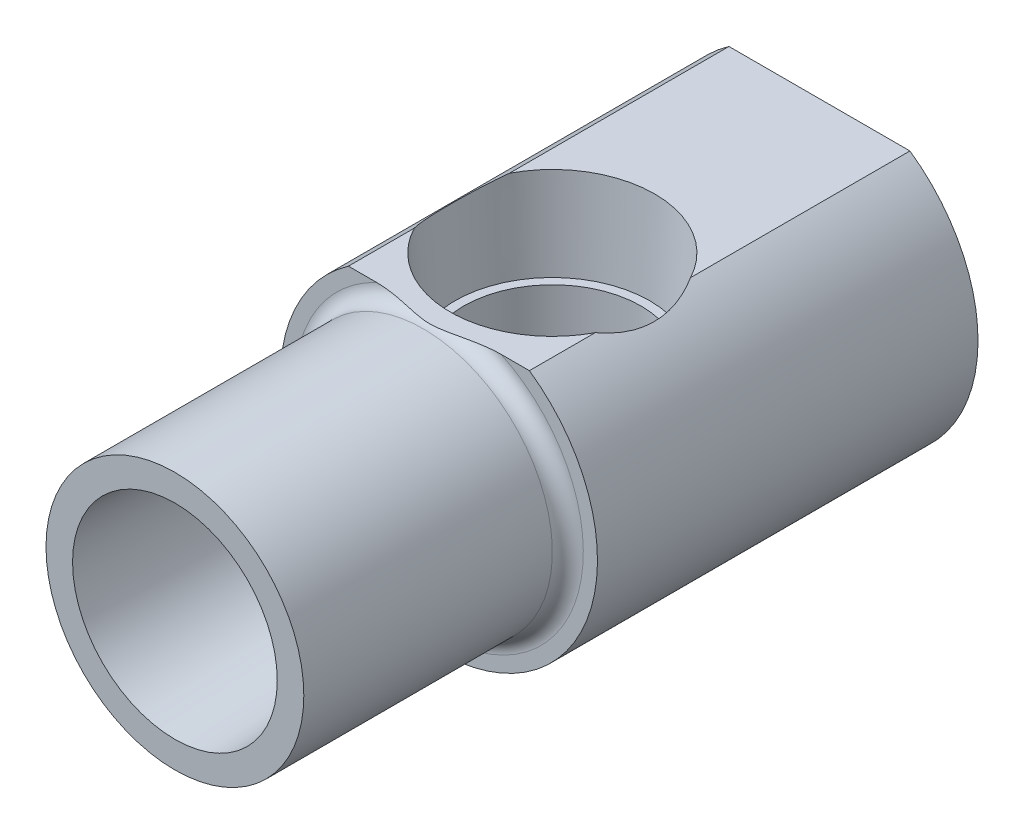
ISO-10303-21;
HEADER;
FILE_DESCRIPTION(('STEP AP214'),'2;1');
FILE_NAME('part.step','',(''),(''),'','','');
FILE_SCHEMA(('AUTOMOTIVE_DESIGN { 1 0 10303 214 1 1 1 1 }'));
ENDSEC;
DATA;
#1=APPLICATION_CONTEXT('core data for automotive mechanical design processes');
#2=APPLICATION_PROTOCOL_DEFINITION('international standard','automotive_design',2000,#1);
#3=PRODUCT_CONTEXT('',#1,'mechanical');
#4=PRODUCT('Part','Part','',(#3));
#5=PRODUCT_RELATED_PRODUCT_CATEGORY('part','',(#4));
#6=PRODUCT_DEFINITION_FORMATION('','',#4);
#7=PRODUCT_DEFINITION_CONTEXT('part definition',#1,'design');
#8=PRODUCT_DEFINITION('design','',#6,#7);
#9=PRODUCT_DEFINITION_SHAPE('','',#8);
#10=(LENGTH_UNIT() NAMED_UNIT(*) SI_UNIT(.MILLI.,.METRE.));
#11=(NAMED_UNIT(*) PLANE_ANGLE_UNIT() SI_UNIT($,.RADIAN.));
#12=(NAMED_UNIT(*) SI_UNIT($,.STERADIAN.) SOLID_ANGLE_UNIT());
#13=UNCERTAINTY_MEASURE_WITH_UNIT(LENGTH_MEASURE(1.E-05),#10,'distance_accuracy_value','');
#14=(GEOMETRIC_REPRESENTATION_CONTEXT(3) GLOBAL_UNCERTAINTY_ASSIGNED_CONTEXT((#13)) GLOBAL_UNIT_ASSIGNED_CONTEXT((#10,
#11,#12)) REPRESENTATION_CONTEXT('',''));
#15=CARTESIAN_POINT('',(0.,0.,0.));
#16=DIRECTION('',(0.,0.,1.));
#17=DIRECTION('',(1.,0.,0.));
#18=AXIS2_PLACEMENT_3D('',#15,#16,#17);
#19=CARTESIAN_POINT('',(0.,-0.0611909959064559,-6.26122966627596));
#20=DIRECTION('',(0.,0.221617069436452,0.975133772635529));
#21=DIRECTION('',(0.,-0.975133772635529,0.221617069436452));
#22=AXIS2_PLACEMENT_3D('',#19,#20,#21);
#23=CONICAL_SURFACE('',#22,4.23998477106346,0.0839179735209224);
#24=CARTESIAN_POINT('',(0.,1.96844905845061,12.3651454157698));
#25=DIRECTION('',(0.,-1.,0.));
#26=DIRECTION('',(0.,0.,1.));
#27=AXIS2_PLACEMENT_3D('',#24,#25,#26);
#28=ELLIPSE('',#27,26.1966635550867,5.39334577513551);
#29=CARTESIAN_POINT('',(-0.278305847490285,1.9684490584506,-13.7966174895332));
#30=VERTEX_POINT('',#29);
#31=CARTESIAN_POINT('',(0.278305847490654,1.9684490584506,-13.7966174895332));
#32=VERTEX_POINT('',#31);
#33=EDGE_CURVE('E240',#30,#32,#28,.T.);
#34=ORIENTED_EDGE('',*,*,#33,.F.);
#35=CARTESIAN_POINT('',(1.04745058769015,1.78154510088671,-13.9141804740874));
#36=CARTESIAN_POINT('',(0.984457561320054,1.80628316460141,-13.8987397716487));
#37=CARTESIAN_POINT('',(0.920346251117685,1.8289900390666,-13.884519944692));
#38=CARTESIAN_POINT('',(0.790174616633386,1.87004304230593,-13.85875113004));
#39=CARTESIAN_POINT('',(0.724113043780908,1.88838630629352,-13.8472038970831));
#40=CARTESIAN_POINT('',(0.590512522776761,1.92035640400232,-13.827045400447));
#41=CARTESIAN_POINT('',(0.522975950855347,1.93399030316,-13.8184297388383));
#42=CARTESIAN_POINT('',(0.386807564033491,1.95633483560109,-13.8042943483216));
#43=CARTESIAN_POINT('',(0.318176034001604,1.96504672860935,-13.7987738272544));
#44=CARTESIAN_POINT('',(0.110722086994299,1.98356031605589,-13.7870398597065));
#45=CARTESIAN_POINT('',(-0.0291890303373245,1.98562568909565,-13.7857263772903));
#46=CARTESIAN_POINT('',(-0.307098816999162,1.96889898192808,-13.7963337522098));
#47=CARTESIAN_POINT('',(-0.445098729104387,1.95012116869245,-13.808245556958));
#48=CARTESIAN_POINT('',(-0.660528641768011,1.90481500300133,-13.8368517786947));
#49=CARTESIAN_POINT('',(-0.739872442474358,1.88449738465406,-13.8496605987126));
#50=CARTESIAN_POINT('',(-0.895813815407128,1.83759126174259,-13.8791312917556));
#51=CARTESIAN_POINT('',(-0.972415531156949,1.8110127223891,-13.8957870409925));
#52=CARTESIAN_POINT('',(-1.04745058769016,1.78154510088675,-13.9141804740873));
#53=B_SPLINE_CURVE_WITH_KNOTS('',3,(#35,#36,#37,#38,#39,#40,#41,#42,#43,#44,#45,#46,#47,#48,#49,
#50,#51,#52),.UNSPECIFIED.,.F.,.F.,(4,2,2,2,2,2,2,2,4),(0.,0.208225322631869,0.41658697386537,
0.624634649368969,0.832629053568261,1.2500670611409,1.66721951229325,1.91557542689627,
2.16353868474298),.UNSPECIFIED.);
#54=EDGE_CURVE('E110',#32,#30,#53,.T.);
#55=ORIENTED_EDGE('',*,*,#54,.F.);
#56=EDGE_LOOP('',(#34,#55));
#57=FACE_BOUND('',#56,.T.);
#58=CARTESIAN_POINT('',(-1.70352259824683,-5.04464323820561,-14.5715056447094));
#59=CARTESIAN_POINT('',(-1.65770976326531,-5.07554222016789,-14.6102429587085));
#60=CARTESIAN_POINT('',(-1.61026644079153,-5.10591733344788,-14.6475351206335));
#61=CARTESIAN_POINT('',(-1.51197859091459,-5.16519074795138,-14.7188224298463));
#62=CARTESIAN_POINT('',(-1.46112947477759,-5.19408696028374,-14.752812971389));
#63=CARTESIAN_POINT('',(-1.35599869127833,-5.24989479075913,-14.8169914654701));
#64=CARTESIAN_POINT('',(-1.30171593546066,-5.27680577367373,-14.8471782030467));
#65=CARTESIAN_POINT('',(-1.18991605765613,-5.32806218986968,-14.9033418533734));
#66=CARTESIAN_POINT('',(-1.13240054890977,-5.35240888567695,-14.9293208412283));
#67=CARTESIAN_POINT('',(-0.954397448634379,-5.42111526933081,-15.0009039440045));
#68=CARTESIAN_POINT('',(-0.829179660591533,-5.46074246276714,-15.0397048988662));
#69=CARTESIAN_POINT('',(-0.57076009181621,-5.5233743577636,-15.0990149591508));
#70=CARTESIAN_POINT('',(-0.437566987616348,-5.54639678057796,-15.1195435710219));
#71=CARTESIAN_POINT('',(-0.180997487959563,-5.57267290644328,-15.1427769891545));
#72=CARTESIAN_POINT('',(-0.0579266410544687,-5.57763189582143,-15.14702147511));
#73=CARTESIAN_POINT('',(0.187614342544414,-5.57227066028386,-15.1423559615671));
#74=CARTESIAN_POINT('',(0.310084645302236,-5.56195492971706,-15.1334498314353));
#75=CARTESIAN_POINT('',(0.553761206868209,-5.52627202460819,-15.1013561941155));
#76=CARTESIAN_POINT('',(0.674878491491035,-5.50057458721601,-15.0778548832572));
#77=CARTESIAN_POINT('',(0.909385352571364,-5.43573892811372,-15.0151397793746));
#78=CARTESIAN_POINT('',(1.02276737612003,-5.39658778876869,-14.9759108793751));
#79=CARTESIAN_POINT('',(1.18397910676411,-5.33056188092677,-14.905978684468));
#80=CARTESIAN_POINT('',(1.23597922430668,-5.30748222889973,-14.8809859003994));
#81=CARTESIAN_POINT('',(1.33721010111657,-5.25927608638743,-14.8275227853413));
#82=CARTESIAN_POINT('',(1.38643982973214,-5.23414884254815,-14.7990511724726));
#83=CARTESIAN_POINT('',(1.48196648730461,-5.18230827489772,-14.7389798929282));
#84=CARTESIAN_POINT('',(1.52826636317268,-5.15559659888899,-14.7073834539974));
#85=CARTESIAN_POINT('',(1.61800596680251,-5.10095202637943,-14.6414304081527));
#86=CARTESIAN_POINT('',(1.66144877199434,-5.07302049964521,-14.6070768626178));
#87=CARTESIAN_POINT('',(1.70352259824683,-5.04464323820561,-14.5715056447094));
#88=B_SPLINE_CURVE_WITH_KNOTS('',3,(#58,#59,#60,#61,#62,#63,#64,#65,#66,#67,#68,#69,#70,#71,#72,
#73,#74,#75,#76,#77,#78,#79,#80,#81,#82,#83,#84,#85,#86,#87),.UNSPECIFIED.,.F.,.F.,(4,2,2,2,2,2,
2,2,2,2,2,2,2,2,4),(0.,0.202471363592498,0.40522123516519,0.608035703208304,0.81074984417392,
1.21896428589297,1.62674241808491,1.99485040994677,2.36285011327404,2.73904979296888,
3.11561169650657,3.30186953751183,3.48819621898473,3.67433240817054,3.86026470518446),.UNSPECIFIED.);
#89=CARTESIAN_POINT('',(-1.70322605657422,-5.04484323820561,-14.5717562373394));
#90=VERTEX_POINT('',#89);
#91=CARTESIAN_POINT('',(1.70322605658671,-5.04484323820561,-14.5717562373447));
#92=VERTEX_POINT('',#91);
#93=EDGE_CURVE('E11',#90,#92,#88,.T.);
#94=ORIENTED_EDGE('',*,*,#93,.F.);
#95=CARTESIAN_POINT('',(1.70283548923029,-5.04504323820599,-14.5715908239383));
#96=CARTESIAN_POINT('',(1.78909952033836,-5.00087286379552,-14.6081035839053));
#97=CARTESIAN_POINT('',(1.87273365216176,-4.95346103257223,-14.6468086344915));
#98=CARTESIAN_POINT('',(2.03436595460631,-4.8524768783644,-14.7276672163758));
#99=CARTESIAN_POINT('',(2.11236700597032,-4.79890774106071,-14.7698189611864));
#100=CARTESIAN_POINT('',(2.26285051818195,-4.68558105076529,-14.8569081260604));
#101=CARTESIAN_POINT('',(2.3353010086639,-4.62579173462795,-14.9018593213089));
#102=CARTESIAN_POINT('',(2.47397180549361,-4.50045215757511,-14.9933372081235));
#103=CARTESIAN_POINT('',(2.54019131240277,-4.43490115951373,-15.0398641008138));
#104=CARTESIAN_POINT('',(2.66609988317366,-4.29821073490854,-15.133345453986));
#105=CARTESIAN_POINT('',(2.72579456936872,-4.22707621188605,-15.1802995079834));
#106=CARTESIAN_POINT('',(2.83847893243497,-4.07918763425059,-15.2734398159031));
#107=CARTESIAN_POINT('',(2.89146786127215,-4.00243295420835,-15.3196259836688));
#108=CARTESIAN_POINT('',(2.99030695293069,-3.84349826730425,-15.4096737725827));
#109=CARTESIAN_POINT('',(3.03617579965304,-3.76133329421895,-15.4535412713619));
#110=CARTESIAN_POINT('',(3.12055101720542,-3.59148925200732,-15.5373995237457));
#111=CARTESIAN_POINT('',(3.15906119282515,-3.50381306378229,-15.5773922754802));
#112=CARTESIAN_POINT('',(3.24131478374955,-3.28912956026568,-15.6655957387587));
#113=CARTESIAN_POINT('',(3.2816126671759,-3.15969416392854,-15.7112711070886));
#114=CARTESIAN_POINT('',(3.34629783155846,-2.89263721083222,-15.7866325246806));
#115=CARTESIAN_POINT('',(3.37071802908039,-2.75503323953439,-15.8163516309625));
#116=CARTESIAN_POINT('',(3.40336517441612,-2.47464574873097,-15.8564555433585));
#117=CARTESIAN_POINT('',(3.41153852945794,-2.3318466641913,-15.8667763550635));
#118=CARTESIAN_POINT('',(3.41238986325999,-2.04610037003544,-15.8678522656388));
#119=CARTESIAN_POINT('',(3.40504617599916,-1.90315323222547,-15.858580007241));
#120=CARTESIAN_POINT('',(3.37200717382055,-1.57508107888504,-15.8178750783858));
#121=CARTESIAN_POINT('',(3.34114357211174,-1.39127151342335,-15.7802437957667));
#122=CARTESIAN_POINT('',(3.27970611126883,-1.12305095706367,-15.7093536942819));
#123=CARTESIAN_POINT('',(3.2566389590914,-1.03471592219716,-15.6832465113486));
#124=CARTESIAN_POINT('',(3.20573417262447,-0.860651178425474,-15.6272516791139));
#125=CARTESIAN_POINT('',(3.17789748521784,-0.774920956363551,-15.5973647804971));
#126=CARTESIAN_POINT('',(3.10367905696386,-0.566913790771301,-15.5201806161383));
#127=CARTESIAN_POINT('',(3.05469185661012,-0.44617377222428,-15.4712484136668));
#128=CARTESIAN_POINT('',(2.94728641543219,-0.210564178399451,-15.3696416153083));
#129=CARTESIAN_POINT('',(2.88886341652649,-0.0956976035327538,-15.3169651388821));
#130=CARTESIAN_POINT('',(2.76262948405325,0.12780987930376,-15.2098274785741));
#131=CARTESIAN_POINT('',(2.69482296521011,0.2364536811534,-15.1553671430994));
#132=CARTESIAN_POINT('',(2.54963756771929,0.446989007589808,-15.0463427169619));
#133=CARTESIAN_POINT('',(2.4722631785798,0.54888366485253,-14.991778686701));
#134=CARTESIAN_POINT('',(2.26876671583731,0.791420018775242,-14.8587081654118));
#135=CARTESIAN_POINT('',(2.13683677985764,0.927736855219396,-14.781015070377));
#136=CARTESIAN_POINT('',(1.8505066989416,1.17961314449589,-14.6341164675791));
#137=CARTESIAN_POINT('',(1.69615715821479,1.2952180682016,-14.564892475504));
#138=CARTESIAN_POINT('',(1.40578911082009,1.4741037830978,-14.4562177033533));
#139=CARTESIAN_POINT('',(1.27458681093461,1.5432615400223,-14.4136307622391));
#140=CARTESIAN_POINT('',(1.00057820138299,1.66241055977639,-14.3397268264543));
#141=CARTESIAN_POINT('',(0.857779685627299,1.71241456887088,-14.3084023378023));
#142=CARTESIAN_POINT('',(0.636748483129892,1.77043663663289,-14.2719188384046));
#143=CARTESIAN_POINT('',(0.561534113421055,1.78698656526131,-14.2614825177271));
#144=CARTESIAN_POINT('',(0.409590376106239,1.81390318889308,-14.2444858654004));
#145=CARTESIAN_POINT('',(0.332861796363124,1.82427301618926,-14.2379235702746));
#146=CARTESIAN_POINT('',(0.178593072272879,1.83856516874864,-14.2288748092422));
#147=CARTESIAN_POINT('',(0.101053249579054,1.84248995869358,-14.2263867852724));
#148=CARTESIAN_POINT('',(-0.0540784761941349,1.84381057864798,-14.2255495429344));
#149=CARTESIAN_POINT('',(-0.131670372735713,1.84120711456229,-14.2271998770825));
#150=CARTESIAN_POINT('',(-0.342562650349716,1.8252369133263,-14.2373160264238));
#151=CARTESIAN_POINT('',(-0.475247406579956,1.80540835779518,-14.2498726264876));
#152=CARTESIAN_POINT('',(-0.734939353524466,1.7477783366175,-14.2861877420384));
#153=CARTESIAN_POINT('',(-0.861944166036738,1.70996941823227,-14.3099509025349));
#154=CARTESIAN_POINT('',(-1.14242245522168,1.60587409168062,-14.3748940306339));
#155=CARTESIAN_POINT('',(-1.29333587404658,1.53457590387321,-14.4190889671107));
#156=CARTESIAN_POINT('',(-1.5795110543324,1.37151355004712,-14.5187332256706));
#157=CARTESIAN_POINT('',(-1.71474450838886,1.27971321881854,-14.5742024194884));
#158=CARTESIAN_POINT('',(-2.01876577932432,1.04104823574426,-14.7156413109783));
#159=CARTESIAN_POINT('',(-2.18006150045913,0.886673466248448,-14.8050676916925));
#160=CARTESIAN_POINT('',(-2.39953896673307,0.637967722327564,-14.9432114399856));
#161=CARTESIAN_POINT('',(-2.46904270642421,0.552064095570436,-14.9900012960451));
#162=CARTESIAN_POINT('',(-2.6008239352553,0.375037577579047,-15.0839505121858));
#163=CARTESIAN_POINT('',(-2.66310237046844,0.283915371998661,-15.1311098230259));
#164=CARTESIAN_POINT('',(-2.78263663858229,0.093642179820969,-15.2263849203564));
#165=CARTESIAN_POINT('',(-2.83964106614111,-0.00567806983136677,-15.2744765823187));
#166=CARTESIAN_POINT('',(-2.94618799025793,-0.209174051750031,-15.3687026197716));
#167=CARTESIAN_POINT('',(-2.99572877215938,-0.313350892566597,-15.4148365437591));
#168=CARTESIAN_POINT('',(-3.08718637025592,-0.526216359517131,-15.503608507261));
#169=CARTESIAN_POINT('',(-3.12911592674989,-0.634897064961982,-15.5462523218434));
#170=CARTESIAN_POINT('',(-3.20513817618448,-0.856769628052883,-15.6263357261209));
#171=CARTESIAN_POINT('',(-3.23923512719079,-0.969958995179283,-15.6637781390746));
#172=CARTESIAN_POINT('',(-3.30708437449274,-1.23165830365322,-15.74039191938));
#173=CARTESIAN_POINT('',(-3.33830086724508,-1.38151198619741,-15.7773428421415));
#174=CARTESIAN_POINT('',(-3.38529311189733,-1.68682904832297,-15.8339974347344));
#175=CARTESIAN_POINT('',(-3.40109986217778,-1.84228051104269,-15.8537357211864));
#176=CARTESIAN_POINT('',(-3.41151293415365,-2.07791909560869,-15.8667492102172));
#177=CARTESIAN_POINT('',(-3.41273024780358,-2.15741537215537,-15.8682745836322));
#178=CARTESIAN_POINT('',(-3.4103417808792,-2.31620629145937,-15.8652821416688));
#179=CARTESIAN_POINT('',(-3.40673841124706,-2.39550101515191,-15.8607673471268));
#180=CARTESIAN_POINT('',(-3.39453795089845,-2.55311030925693,-15.8456239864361));
#181=CARTESIAN_POINT('',(-3.38594139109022,-2.63142498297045,-15.8349960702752));
#182=CARTESIAN_POINT('',(-3.36372284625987,-2.78629867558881,-15.8079402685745));
#183=CARTESIAN_POINT('',(-3.3501009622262,-2.86285772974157,-15.7915124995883));
#184=CARTESIAN_POINT('',(-3.30625407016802,-3.06803804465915,-15.739676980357));
#185=CARTESIAN_POINT('',(-3.27114153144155,-3.19435725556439,-15.699127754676));
#186=CARTESIAN_POINT('',(-3.18705935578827,-3.43797729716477,-15.6067844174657));
#187=CARTESIAN_POINT('',(-3.13806932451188,-3.55526452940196,-15.554973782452));
#188=CARTESIAN_POINT('',(-3.04208266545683,-3.7500853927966,-15.459302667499));
#189=CARTESIAN_POINT('',(-2.99803642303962,-3.82988123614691,-15.4170050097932));
#190=CARTESIAN_POINT('',(-2.90336846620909,-3.98426421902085,-15.3302327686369));
#191=CARTESIAN_POINT('',(-2.85274411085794,-4.05884924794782,-15.2857573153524));
#192=CARTESIAN_POINT('',(-2.74517580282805,-4.20282183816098,-15.1959348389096));
#193=CARTESIAN_POINT('',(-2.68822843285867,-4.27220655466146,-15.1505873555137));
#194=CARTESIAN_POINT('',(-2.56826558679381,-4.40572347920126,-15.0601751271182));
#195=CARTESIAN_POINT('',(-2.5052482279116,-4.46985404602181,-15.0151104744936));
#196=CARTESIAN_POINT('',(-2.33135996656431,-4.6318927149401,-14.8980192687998));
#197=CARTESIAN_POINT('',(-2.21552549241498,-4.72537087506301,-14.8270555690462));
#198=CARTESIAN_POINT('',(-2.03104784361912,-4.8540678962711,-14.726337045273));
#199=CARTESIAN_POINT('',(-1.96783374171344,-4.89501291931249,-14.6937473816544));
#200=CARTESIAN_POINT('',(-1.8379140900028,-4.97299625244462,-14.6308494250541));
#201=CARTESIAN_POINT('',(-1.77120705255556,-5.01003287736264,-14.6005421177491));
#202=CARTESIAN_POINT('',(-1.70283548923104,-5.04504323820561,-14.5715908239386));
#203=B_SPLINE_CURVE_WITH_KNOTS('',3,(#95,#96,#97,#98,#99,#100,#101,#102,#103,#104,#105,#106,
#107,#108,#109,#110,#111,#112,#113,#114,#115,#116,#117,#118,#119,#120,#121,#122,#123,#124,#125,
#126,#127,#128,#129,#130,#131,#132,#133,#134,#135,#136,#137,#138,#139,#140,#141,#142,#143,#144,
#145,#146,#147,#148,#149,#150,#151,#152,#153,#154,#155,#156,#157,#158,#159,#160,#161,#162,#163,
#164,#165,#166,#167,#168,#169,#170,#171,#172,#173,#174,#175,#176,#177,#178,#179,#180,#181,#182,
#183,#184,#185,#186,#187,#188,#189,#190,#191,#192,#193,#194,#195,#196,#197,#198,#199,#200,#201,
#202),.UNSPECIFIED.,.F.,.F.,(4,2,2,2,2,2,2,2,2,2,2,2,2,2,2,2,2,2,2,2,2,2,2,2,2,2,2,2,2,2,2,2,2,
2,2,2,2,2,2,2,2,2,2,2,2,2,2,2,2,2,2,2,2,4),(0.,0.310537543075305,0.620915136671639,
0.932963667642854,1.24505218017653,1.55686961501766,1.86872180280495,2.17974129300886,
2.49059953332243,2.91793102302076,3.34437374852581,3.77222084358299,4.20066572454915,
4.76771468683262,5.05243468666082,5.33709822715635,5.75409162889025,6.17129596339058,
6.58830467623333,7.00511845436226,7.61803506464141,8.22958913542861,8.69085999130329,
9.15182334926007,9.38467470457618,9.61740794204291,9.85005215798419,10.0826712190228,
10.4848355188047,10.8871666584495,11.4022775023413,11.918304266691,12.6356480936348,
12.9954212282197,13.3551472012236,13.727437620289,14.0998134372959,14.4715600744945,
14.8431041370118,15.3141113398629,15.7841690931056,16.0224049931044,16.2605217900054,
16.4986132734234,16.7366999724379,17.1466117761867,17.5571291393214,17.8582054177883,
18.1594029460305,18.4607640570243,18.7622189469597,19.2552217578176,19.5012491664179,
19.7473822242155),.UNSPECIFIED.);
#204=EDGE_CURVE('E26',#92,#90,#203,.T.);
#205=ORIENTED_EDGE('',*,*,#204,.F.);
#206=EDGE_LOOP('',(#94,#205));
#207=FACE_BOUND('',#206,.T.);
#208=CARTESIAN_POINT('',(0.,-0.365328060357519,-7.95274430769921));
#209=DIRECTION('',(0.,0.,1.));
#210=DIRECTION('',(0.,1.,0.));
#211=AXIS2_PLACEMENT_3D('',#208,#209,#210);
#212=ELLIPSE('',#211,4.20000899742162,4.0948221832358);
#213=CARTESIAN_POINT('',(0.,3.83468093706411,-7.95274430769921));
#214=VERTEX_POINT('',#213);
#215=EDGE_CURVE('E20',#214,#214,#212,.T.);
#216=ORIENTED_EDGE('',*,*,#215,.T.);
#217=EDGE_LOOP('',(#216));
#218=FACE_BOUND('',#217,.T.);
#219=ADVANCED_FACE('F16',(#57,#207,#218),#23,.F.);
#220=CARTESIAN_POINT('',(-4.4577,6.41348742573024,0.));
#221=DIRECTION('',(0.,-1.,0.));
#222=DIRECTION('',(0.,0.,-1.));
#223=AXIS2_PLACEMENT_3D('',#220,#221,#222);
#224=PLANE('',#223);
#225=DIRECTION('',(0.,0.,-1.));
#226=VECTOR('',#225,1.);
#227=CARTESIAN_POINT('',(4.4577,6.41348742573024,0.));
#228=LINE('',#227,#226);
#229=CARTESIAN_POINT('',(4.4577,6.41348742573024,-13.0048));
#230=VERTEX_POINT('',#229);
#231=CARTESIAN_POINT('',(4.4577,6.41348742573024,-16.2462086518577));
#232=VERTEX_POINT('',#231);
#233=EDGE_CURVE('E100',#230,#232,#228,.T.);
#234=ORIENTED_EDGE('',*,*,#233,.T.);
#235=CARTESIAN_POINT('',(0.,6.41348742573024,-18.5928));
#236=DIRECTION('',(0.,-1.,0.));
#237=DIRECTION('',(0.,0.,-1.));
#238=AXIS2_PLACEMENT_3D('',#235,#236,#237);
#239=CIRCLE('',#238,5.03761652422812);
#240=CARTESIAN_POINT('',(-4.4577,6.41348742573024,-16.2462086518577));
#241=VERTEX_POINT('',#240);
#242=EDGE_CURVE('E260',#232,#241,#239,.T.);
#243=ORIENTED_EDGE('',*,*,#242,.T.);
#244=DIRECTION('',(0.,0.,-1.));
#245=VECTOR('',#244,1.);
#246=CARTESIAN_POINT('',(-4.4577,6.41348742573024,0.));
#247=LINE('',#246,#245);
#248=CARTESIAN_POINT('',(-4.4577,6.41348742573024,-13.0048));
#249=VERTEX_POINT('',#248);
#250=EDGE_CURVE('E298',#249,#241,#247,.T.);
#251=ORIENTED_EDGE('',*,*,#250,.F.);
#252=DIRECTION('',(1.,0.,0.));
#253=VECTOR('',#252,1.);
#254=CARTESIAN_POINT('',(-7.112,6.41348742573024,-13.0048));
#255=LINE('',#254,#253);
#256=CARTESIAN_POINT('',(-3.07371485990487,6.41348742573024,-13.0048));
#257=VERTEX_POINT('',#256);
#258=EDGE_CURVE('E303',#249,#257,#255,.T.);
#259=ORIENTED_EDGE('',*,*,#258,.T.);
#260=CARTESIAN_POINT('',(0.,6.41348742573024,-12.5473064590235));
#261=CARTESIAN_POINT('',(0.0547669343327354,6.41348742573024,-12.5473026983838));
#262=CARTESIAN_POINT('',(0.109530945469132,6.41348742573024,-12.5489319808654));
#263=CARTESIAN_POINT('',(0.21888843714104,6.41348742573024,-12.5552344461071));
#264=CARTESIAN_POINT('',(0.273481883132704,6.41348742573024,-12.5599082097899));
#265=CARTESIAN_POINT('',(0.43713368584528,6.41348742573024,-12.5777547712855));
#266=CARTESIAN_POINT('',(0.545759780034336,6.41348742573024,-12.5947480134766));
#267=CARTESIAN_POINT('',(0.763468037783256,6.41348742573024,-12.6342609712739));
#268=CARTESIAN_POINT('',(0.872535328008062,6.41348742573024,-12.6568546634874));
#269=CARTESIAN_POINT('',(1.09015205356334,6.41348742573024,-12.7038057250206));
#270=CARTESIAN_POINT('',(1.19870193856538,6.41348742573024,-12.7281610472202));
#271=CARTESIAN_POINT('',(1.441224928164,6.41348742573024,-12.7820312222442));
#272=CARTESIAN_POINT('',(1.57522547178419,6.41348742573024,-12.811425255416));
#273=CARTESIAN_POINT('',(1.84407607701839,6.41348742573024,-12.8665592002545));
#274=CARTESIAN_POINT('',(1.97892653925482,6.41348742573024,-12.8922972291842));
#275=CARTESIAN_POINT('',(2.24890278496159,6.41348742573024,-12.9374462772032));
#276=CARTESIAN_POINT('',(2.38402236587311,6.41348742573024,-12.956893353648));
#277=CARTESIAN_POINT('',(2.65521795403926,6.41348742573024,-12.9870017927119));
#278=CARTESIAN_POINT('',(2.79129309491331,6.41348742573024,-12.9976702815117));
#279=CARTESIAN_POINT('',(2.99640645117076,6.41348742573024,-13.0046072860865));
#280=CARTESIAN_POINT('',(3.06529255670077,6.41348742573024,-13.0053893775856));
#281=CARTESIAN_POINT('',(3.20300193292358,6.41348742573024,-13.0033008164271));
#282=CARTESIAN_POINT('',(3.27182521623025,6.41348742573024,-13.0004312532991));
#283=CARTESIAN_POINT('',(3.40907712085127,6.41348742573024,-12.9903808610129));
#284=CARTESIAN_POINT('',(3.47750615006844,6.41348742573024,-12.983205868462));
#285=CARTESIAN_POINT('',(3.61360674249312,6.41348742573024,-12.963713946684));
#286=CARTESIAN_POINT('',(3.68127881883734,6.41348742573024,-12.9514007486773));
#287=CARTESIAN_POINT('',(3.81134745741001,6.41348742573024,-12.9214383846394));
#288=CARTESIAN_POINT('',(3.87382282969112,6.41348742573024,-12.9041388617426));
#289=CARTESIAN_POINT('',(3.99661419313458,6.41348742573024,-12.8627905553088));
#290=CARTESIAN_POINT('',(4.05692926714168,6.41348742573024,-12.8387389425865));
#291=CARTESIAN_POINT('',(4.16438836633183,6.41348742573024,-12.7867879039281));
#292=CARTESIAN_POINT('',(4.21210790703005,6.41348742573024,-12.7600964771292));
#293=CARTESIAN_POINT('',(4.30289303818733,6.41348742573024,-12.6996771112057));
#294=CARTESIAN_POINT('',(4.34597104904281,6.41348742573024,-12.6659686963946));
#295=CARTESIAN_POINT('',(4.40881816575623,6.41348742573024,-12.6054646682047));
#296=CARTESIAN_POINT('',(4.43105110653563,6.41348742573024,-12.5812380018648));
#297=CARTESIAN_POINT('',(4.47168650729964,6.41348742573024,-12.5297394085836));
#298=CARTESIAN_POINT('',(4.49009362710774,6.41348742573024,-12.5024712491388));
#299=CARTESIAN_POINT('',(4.51921410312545,6.41348742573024,-12.44984266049));
#300=CARTESIAN_POINT('',(4.53069614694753,6.41348742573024,-12.4249113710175));
#301=CARTESIAN_POINT('',(4.54935954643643,6.41348742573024,-12.37347800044));
#302=CARTESIAN_POINT('',(4.55654415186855,6.41348742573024,-12.3469771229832));
#303=CARTESIAN_POINT('',(4.56604079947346,6.41348742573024,-12.2929449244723));
#304=CARTESIAN_POINT('',(4.56832514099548,6.41348742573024,-12.2654086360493));
#305=CARTESIAN_POINT('',(4.56771494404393,6.41348742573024,-12.2103946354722));
#306=CARTESIAN_POINT('',(4.56482077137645,6.41348742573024,-12.1829169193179));
#307=CARTESIAN_POINT('',(4.55461750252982,6.41348742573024,-12.1313731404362));
#308=CARTESIAN_POINT('',(4.54772671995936,6.41348742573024,-12.1072218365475));
#309=CARTESIAN_POINT('',(4.53037439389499,6.41348742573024,-12.0602515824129));
#310=CARTESIAN_POINT('',(4.51991160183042,6.41348742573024,-12.0374331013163));
#311=CARTESIAN_POINT('',(4.49089034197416,6.41348742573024,-11.9840531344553));
#312=CARTESIAN_POINT('',(4.47078194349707,6.41348742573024,-11.9543352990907));
#313=CARTESIAN_POINT('',(4.42607813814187,6.41348742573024,-11.8984940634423));
#314=CARTESIAN_POINT('',(4.40147230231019,6.41348742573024,-11.8723792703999));
#315=CARTESIAN_POINT('',(4.33512083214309,6.41348742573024,-11.8106462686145));
#316=CARTESIAN_POINT('',(4.29121960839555,6.41348742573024,-11.777360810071));
#317=CARTESIAN_POINT('',(4.19894894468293,6.41348742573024,-11.7177920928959));
#318=CARTESIAN_POINT('',(4.1505702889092,6.41348742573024,-11.6915237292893));
#319=CARTESIAN_POINT('',(4.05679374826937,6.41348742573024,-11.6475290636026));
#320=CARTESIAN_POINT('',(4.01168660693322,6.41348742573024,-11.6291697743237));
#321=CARTESIAN_POINT('',(3.9200501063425,6.41348742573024,-11.5963828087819));
#322=CARTESIAN_POINT('',(3.8735196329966,6.41348742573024,-11.5819583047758));
#323=CARTESIAN_POINT('',(3.73245646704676,6.41348742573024,-11.5437154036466));
#324=CARTESIAN_POINT('',(3.63654836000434,6.41348742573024,-11.5249691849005));
#325=CARTESIAN_POINT('',(3.44110716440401,6.41348742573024,-11.4974004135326));
#326=CARTESIAN_POINT('',(3.34154251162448,6.41348742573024,-11.4888289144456));
#327=CARTESIAN_POINT('',(3.14195452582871,6.41348742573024,-11.4800174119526));
#328=CARTESIAN_POINT('',(3.04193075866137,6.41348742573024,-11.4797885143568));
#329=CARTESIAN_POINT('',(2.84160218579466,6.41348742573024,-11.4859359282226));
#330=CARTESIAN_POINT('',(2.74129862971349,6.41348742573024,-11.4923466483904));
#331=CARTESIAN_POINT('',(2.54132534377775,6.41348742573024,-11.5104184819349));
#332=CARTESIAN_POINT('',(2.44165493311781,6.41348742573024,-11.5220723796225));
#333=CARTESIAN_POINT('',(2.13711894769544,6.41348742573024,-11.5640639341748));
#334=CARTESIAN_POINT('',(1.93319771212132,6.41348742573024,-11.6010857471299));
#335=CARTESIAN_POINT('',(1.62827949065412,6.41348742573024,-11.6631574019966));
#336=CARTESIAN_POINT('',(1.52655364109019,6.41348742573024,-11.6849991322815));
#337=CARTESIAN_POINT('',(1.32330984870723,6.41348742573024,-11.72963124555));
#338=CARTESIAN_POINT('',(1.22179189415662,6.41348742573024,-11.7524215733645));
#339=CARTESIAN_POINT('',(1.02058637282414,6.41348742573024,-11.7969213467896));
#340=CARTESIAN_POINT('',(0.920901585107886,6.41348742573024,-11.8186431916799));
#341=CARTESIAN_POINT('',(0.720902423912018,6.41348742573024,-11.8592868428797));
#342=CARTESIAN_POINT('',(0.6205878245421,6.41348742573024,-11.8782075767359));
#343=CARTESIAN_POINT('',(0.419827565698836,6.41348742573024,-11.909665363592));
#344=CARTESIAN_POINT('',(0.319392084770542,6.41348742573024,-11.9222609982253));
#345=CARTESIAN_POINT('',(0.168224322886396,6.41348742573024,-11.9337014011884));
#346=CARTESIAN_POINT('',(0.11777996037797,6.41348742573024,-11.9362733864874));
#347=CARTESIAN_POINT('',(0.0168277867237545,6.41348742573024,-11.9386961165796));
#348=CARTESIAN_POINT('',(-0.0336800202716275,6.41348742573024,-11.938547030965));
#349=CARTESIAN_POINT('',(-0.16720306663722,6.41348742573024,-11.9345344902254));
#350=CARTESIAN_POINT('',(-0.250151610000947,6.41348742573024,-11.928334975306));
#351=CARTESIAN_POINT('',(-0.415406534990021,6.41348742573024,-11.9101085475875));
#352=CARTESIAN_POINT('',(-0.497712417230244,6.41348742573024,-11.8980774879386));
#353=CARTESIAN_POINT('',(-0.662364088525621,6.41348742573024,-11.8702846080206));
#354=CARTESIAN_POINT('',(-0.744704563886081,6.41348742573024,-11.8544927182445));
#355=CARTESIAN_POINT('',(-0.908954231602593,6.41348742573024,-11.821025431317));
#356=CARTESIAN_POINT('',(-0.990863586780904,6.41348742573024,-11.803350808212));
#357=CARTESIAN_POINT('',(-1.15599570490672,6.41348742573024,-11.7670569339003));
#358=CARTESIAN_POINT('',(-1.23921597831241,6.41348742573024,-11.7484264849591));
#359=CARTESIAN_POINT('',(-1.40572088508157,6.41348742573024,-11.7114711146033));
#360=CARTESIAN_POINT('',(-1.48900551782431,6.41348742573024,-11.6931461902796));
#361=CARTESIAN_POINT('',(-1.73866654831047,6.41348742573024,-11.6398714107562));
#362=CARTESIAN_POINT('',(-1.90540243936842,6.41348742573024,-11.6064889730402));
#363=CARTESIAN_POINT('',(-2.16681921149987,6.41348742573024,-11.5615341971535));
#364=CARTESIAN_POINT('',(-2.26095047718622,6.41348742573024,-11.5468255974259));
#365=CARTESIAN_POINT('',(-2.44971550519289,6.41348742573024,-11.5211487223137));
#366=CARTESIAN_POINT('',(-2.54434917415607,6.41348742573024,-11.5101797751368));
#367=CARTESIAN_POINT('',(-2.73368335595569,6.41348742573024,-11.4930011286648));
#368=CARTESIAN_POINT('',(-2.82838206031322,6.41348742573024,-11.4867724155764));
#369=CARTESIAN_POINT('',(-3.01793602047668,6.41348742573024,-11.4801721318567));
#370=CARTESIAN_POINT('',(-3.11279113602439,6.41348742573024,-11.4797967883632));
#371=CARTESIAN_POINT('',(-3.31218734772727,6.41348742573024,-11.4866981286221));
#372=CARTESIAN_POINT('',(-3.41671052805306,6.41348742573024,-11.4947741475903));
#373=CARTESIAN_POINT('',(-3.57234667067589,6.41348742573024,-11.5156108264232));
#374=CARTESIAN_POINT('',(-3.6240470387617,6.41348742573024,-11.5240134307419));
#375=CARTESIAN_POINT('',(-3.72677708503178,6.41348742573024,-11.5441929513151));
#376=CARTESIAN_POINT('',(-3.77780699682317,6.41348742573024,-11.5559686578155));
#377=CARTESIAN_POINT('',(-3.89634421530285,6.41348742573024,-11.5882037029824));
#378=CARTESIAN_POINT('',(-3.96343170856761,6.41348742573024,-11.6102581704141));
#379=CARTESIAN_POINT('',(-4.09405850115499,6.41348742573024,-11.6632132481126));
#380=CARTESIAN_POINT('',(-4.15760463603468,6.41348742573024,-11.6940960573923));
#381=CARTESIAN_POINT('',(-4.25441976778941,6.41348742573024,-11.7526884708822));
#382=CARTESIAN_POINT('',(-4.28979385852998,6.41348742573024,-11.7768976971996));
#383=CARTESIAN_POINT('',(-4.35685699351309,6.41348742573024,-11.8300233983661));
#384=CARTESIAN_POINT('',(-4.38855051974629,6.41348742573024,-11.85893404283));
#385=CARTESIAN_POINT('',(-4.43937896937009,6.41348742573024,-11.9142131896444));
#386=CARTESIAN_POINT('',(-4.45969325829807,6.41348742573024,-11.9394886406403));
#387=CARTESIAN_POINT('',(-4.49606293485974,6.41348742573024,-11.9929532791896));
#388=CARTESIAN_POINT('',(-4.51212457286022,6.41348742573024,-12.0211381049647));
#389=CARTESIAN_POINT('',(-4.53626721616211,6.41348742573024,-12.0745297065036));
#390=CARTESIAN_POINT('',(-4.54527744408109,6.41348742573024,-12.0993134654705));
#391=CARTESIAN_POINT('',(-4.55902605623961,6.41348742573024,-12.1500436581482));
#392=CARTESIAN_POINT('',(-4.56376753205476,6.41348742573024,-12.175989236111));
#393=CARTESIAN_POINT('',(-4.56859445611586,6.41348742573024,-12.228405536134));
#394=CARTESIAN_POINT('',(-4.5686642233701,6.41348742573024,-12.2548777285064));
#395=CARTESIAN_POINT('',(-4.56410153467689,6.41348742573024,-12.307412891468));
#396=CARTESIAN_POINT('',(-4.55946793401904,6.41348742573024,-12.3334757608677));
#397=CARTESIAN_POINT('',(-4.54620785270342,6.41348742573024,-12.3832509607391));
#398=CARTESIAN_POINT('',(-4.53777611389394,6.41348742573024,-12.4070162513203));
#399=CARTESIAN_POINT('',(-4.5175452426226,6.41348742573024,-12.4530512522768));
#400=CARTESIAN_POINT('',(-4.50574488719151,6.41348742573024,-12.4753204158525));
#401=CARTESIAN_POINT('',(-4.47265204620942,6.41348742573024,-12.5290366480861));
#402=CARTESIAN_POINT('',(-4.44958451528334,6.41348742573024,-12.5593900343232));
#403=CARTESIAN_POINT('',(-4.39893449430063,6.41348742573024,-12.6160628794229));
#404=CARTESIAN_POINT('',(-4.37134039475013,6.41348742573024,-12.6423716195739));
#405=CARTESIAN_POINT('',(-4.29637766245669,6.41348742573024,-12.7051367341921));
#406=CARTESIAN_POINT('',(-4.2467063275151,6.41348742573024,-12.7388236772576));
#407=CARTESIAN_POINT('',(-4.1429475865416,6.41348742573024,-12.798403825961));
#408=CARTESIAN_POINT('',(-4.08885088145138,6.41348742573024,-12.8242800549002));
#409=CARTESIAN_POINT('',(-3.98330416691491,6.41348742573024,-12.8674658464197));
#410=CARTESIAN_POINT('',(-3.93208515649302,6.41348742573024,-12.8853529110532));
#411=CARTESIAN_POINT('',(-3.82828626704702,6.41348742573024,-12.916692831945));
#412=CARTESIAN_POINT('',(-3.77570527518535,6.41348742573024,-12.9301419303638));
#413=CARTESIAN_POINT('',(-3.66966451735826,6.41348742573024,-12.9532674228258));
#414=CARTESIAN_POINT('',(-3.61620370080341,6.41348742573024,-12.9629389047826));
#415=CARTESIAN_POINT('',(-3.50882362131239,6.41348742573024,-12.9790139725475));
#416=CARTESIAN_POINT('',(-3.45490452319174,6.41348742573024,-12.9854186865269));
#417=CARTESIAN_POINT('',(-3.32893010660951,6.41348742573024,-12.9970546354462));
#418=CARTESIAN_POINT('',(-3.25677506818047,6.41348742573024,-13.0011969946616));
#419=CARTESIAN_POINT('',(-3.11233636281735,6.41348742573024,-13.0052999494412));
#420=CARTESIAN_POINT('',(-3.04005265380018,6.41348742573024,-13.0052587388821));
#421=CARTESIAN_POINT('',(-2.8231114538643,6.41348742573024,-12.9998652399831));
#422=CARTESIAN_POINT('',(-2.67858508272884,6.41348742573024,-12.9892271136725));
#423=CARTESIAN_POINT('',(-2.38941343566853,6.41348742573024,-12.9578264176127));
#424=CARTESIAN_POINT('',(-2.24477928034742,6.41348742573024,-12.9369716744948));
#425=CARTESIAN_POINT('',(-1.95690250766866,6.41348742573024,-12.8883783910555));
#426=CARTESIAN_POINT('',(-1.81365833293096,6.41348742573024,-12.8606487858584));
#427=CARTESIAN_POINT('',(-1.53108031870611,6.41348742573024,-12.8019540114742));
#428=CARTESIAN_POINT('',(-1.39172865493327,6.41348742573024,-12.7710712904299));
#429=CARTESIAN_POINT('',(-1.18259583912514,6.41348742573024,-12.724545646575));
#430=CARTESIAN_POINT('',(-1.11279428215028,6.41348742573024,-12.7089871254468));
#431=CARTESIAN_POINT('',(-0.973069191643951,6.41348742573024,-12.6784319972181));
#432=CARTESIAN_POINT('',(-0.903145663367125,6.41348742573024,-12.6634353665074));
#433=CARTESIAN_POINT('',(-0.76429608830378,6.41348742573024,-12.6350594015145));
#434=CARTESIAN_POINT('',(-0.695375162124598,6.41348742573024,-12.6216555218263));
#435=CARTESIAN_POINT('',(-0.557105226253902,6.41348742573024,-12.597172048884));
#436=CARTESIAN_POINT('',(-0.487756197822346,6.41348742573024,-12.5860925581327));
#437=CARTESIAN_POINT('',(-0.348841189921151,6.41348742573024,-12.5675649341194));
#438=CARTESIAN_POINT('',(-0.279277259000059,6.41348742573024,-12.5601021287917));
#439=CARTESIAN_POINT('',(-0.139807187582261,6.41348742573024,-12.549976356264));
#440=CARTESIAN_POINT('',(-0.0699012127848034,6.41348742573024,-12.5473112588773));
#441=CARTESIAN_POINT('',(0.,6.41348742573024,-12.5473064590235));
#442=B_SPLINE_CURVE_WITH_KNOTS('',3,(#260,#261,#262,#263,#264,#265,#266,#267,#268,#269,#270,
#271,#272,#273,#274,#275,#276,#277,#278,#279,#280,#281,#282,#283,#284,#285,#286,#287,#288,#289,
#290,#291,#292,#293,#294,#295,#296,#297,#298,#299,#300,#301,#302,#303,#304,#305,#306,#307,#308,
#309,#310,#311,#312,#313,#314,#315,#316,#317,#318,#319,#320,#321,#322,#323,#324,#325,#326,#327,
#328,#329,#330,#331,#332,#333,#334,#335,#336,#337,#338,#339,#340,#341,#342,#343,#344,#345,#346,
#347,#348,#349,#350,#351,#352,#353,#354,#355,#356,#357,#358,#359,#360,#361,#362,#363,#364,#365,
#366,#367,#368,#369,#370,#371,#372,#373,#374,#375,#376,#377,#378,#379,#380,#381,#382,#383,#384,
#385,#386,#387,#388,#389,#390,#391,#392,#393,#394,#395,#396,#397,#398,#399,#400,#401,#402,#403,
#404,#405,#406,#407,#408,#409,#410,#411,#412,#413,#414,#415,#416,#417,#418,#419,#420,#421,#422,
#423,#424,#425,#426,#427,#428,#429,#430,#431,#432,#433,#434,#435,#436,#437,#438,#439,#440,#441),
.UNSPECIFIED.,.T.,.F.,(4,2,2,2,2,2,2,2,2,2,2,2,2,2,2,2,2,2,2,2,2,2,2,2,2,2,2,2,2,2,2,2,2,2,2,2,
2,2,2,2,2,2,2,2,2,2,2,2,2,2,2,2,2,2,2,2,2,2,2,2,2,2,2,2,2,2,2,2,2,2,2,2,2,2,2,2,2,2,2,2,2,2,2,2,
2,2,2,2,2,2,4),(0.,0.164273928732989,0.328579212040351,0.658096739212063,0.992223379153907,
1.325967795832,1.73751584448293,2.14927506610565,2.55863060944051,2.96765352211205,
3.17424892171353,3.38078269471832,3.5870371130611,3.79314201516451,3.98733137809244,
4.18160222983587,4.34518473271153,4.50831802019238,4.60668262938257,4.70492671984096,
4.78693922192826,4.86888962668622,4.95130208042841,5.03370871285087,5.10874003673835,
5.18379761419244,5.29083718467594,5.39812818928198,5.5624830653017,5.72718409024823,
5.87307196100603,6.01907710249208,6.31139884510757,6.61079267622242,6.91058505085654,
7.21193886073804,7.51287920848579,8.13412004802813,8.44626765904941,8.75839714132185,
9.06445930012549,9.37063833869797,9.67392675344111,9.82538795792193,9.97683972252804,
10.2260774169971,10.4754926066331,10.7269732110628,10.9783508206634,11.2341897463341,
11.490026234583,11.9999950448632,12.285756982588,12.5714675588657,12.8560259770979,
13.140400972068,13.4543312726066,13.6113768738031,13.7683662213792,13.9797728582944,
14.1907561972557,14.3190471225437,14.4471801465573,14.5441362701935,14.6409490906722,
14.7197308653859,14.7984555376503,14.8774444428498,14.9564525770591,15.031803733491,
15.1071822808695,15.2209045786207,15.3349232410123,15.5139662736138,15.6933957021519,
15.8559161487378,16.0185738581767,16.1814423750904,16.344254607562,16.5609200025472,
16.7776789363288,17.2118589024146,17.6500302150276,18.0876350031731,18.5158248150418,
18.7303690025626,18.9449041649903,19.1555191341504,19.3661433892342,19.5759058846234,
19.7855752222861),.UNSPECIFIED.);
#443=CARTESIAN_POINT('',(3.07371485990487,6.41348742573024,-13.0048));
#444=VERTEX_POINT('',#443);
#445=EDGE_CURVE('E107',#257,#444,#442,.T.);
#446=ORIENTED_EDGE('',*,*,#445,.T.);
#447=EDGE_CURVE('E297',#444,#230,#255,.T.);
#448=ORIENTED_EDGE('',*,*,#447,.T.);
#449=EDGE_LOOP('',(#234,#243,#251,#259,#446,#448));
#450=FACE_BOUND('',#449,.T.);
#451=ADVANCED_FACE('F214',(#450),#224,.F.);
#452=CARTESIAN_POINT('',(-4.3815,0.,0.));
#453=DIRECTION('',(0.,0.,1.));
#454=DIRECTION('',(1.,0.,0.));
#455=AXIS2_PLACEMENT_3D('',#452,#453,#454);
#456=PLANE('',#455);
#457=CARTESIAN_POINT('',(0.,0.,0.));
#458=DIRECTION('',(0.,0.,1.));
#459=DIRECTION('',(0.,-1.,0.));
#460=AXIS2_PLACEMENT_3D('',#457,#458,#459);
#461=CIRCLE('',#460,5.0419);
#462=CARTESIAN_POINT('',(0.,-5.0419,0.));
#463=VERTEX_POINT('',#462);
#464=EDGE_CURVE('E252',#463,#463,#461,.T.);
#465=ORIENTED_EDGE('',*,*,#464,.F.);
#466=EDGE_LOOP('',(#465));
#467=FACE_BOUND('',#466,.T.);
#468=CARTESIAN_POINT('',(0.,0.,0.));
#469=DIRECTION('',(0.,0.,1.));
#470=DIRECTION('',(1.,0.,0.));
#471=AXIS2_PLACEMENT_3D('',#468,#469,#470);
#472=CIRCLE('',#471,6.35);
#473=CARTESIAN_POINT('',(6.35,0.,0.));
#474=VERTEX_POINT('',#473);
#475=EDGE_CURVE('E247',#474,#474,#472,.F.);
#476=ORIENTED_EDGE('',*,*,#475,.F.);
#477=EDGE_LOOP('',(#476));
#478=FACE_BOUND('',#477,.T.);
#479=ADVANCED_FACE('F211',(#467,#478),#456,.T.);
#480=CARTESIAN_POINT('',(-7.8105,0.,-31.75));
#481=DIRECTION('',(0.,0.,-1.));
#482=DIRECTION('',(-1.,0.,0.));
#483=AXIS2_PLACEMENT_3D('',#480,#481,#482);
#484=PLANE('',#483);
#485=DIRECTION('',(1.,0.,0.));
#486=VECTOR('',#485,1.);
#487=CARTESIAN_POINT('',(-2.29502505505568,3.9751,-31.75));
#488=LINE('',#487,#486);
#489=CARTESIAN_POINT('',(-2.29502505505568,3.9751,-31.75));
#490=VERTEX_POINT('',#489);
#491=CARTESIAN_POINT('',(2.29502505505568,3.9751,-31.75));
#492=VERTEX_POINT('',#491);
#493=EDGE_CURVE('E132',#490,#492,#488,.T.);
#494=ORIENTED_EDGE('',*,*,#493,.F.);
#495=DIRECTION('',(0.5,0.866025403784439,0.));
#496=VECTOR('',#495,1.);
#497=CARTESIAN_POINT('',(-4.59005011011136,0.,-31.75));
#498=LINE('',#497,#496);
#499=CARTESIAN_POINT('',(-4.59005011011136,0.,-31.75));
#500=VERTEX_POINT('',#499);
#501=EDGE_CURVE('E116',#500,#490,#498,.T.);
#502=ORIENTED_EDGE('',*,*,#501,.F.);
#503=DIRECTION('',(-0.5,0.866025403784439,0.));
#504=VECTOR('',#503,1.);
#505=CARTESIAN_POINT('',(-2.29502505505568,-3.9751,-31.75));
#506=LINE('',#505,#504);
#507=CARTESIAN_POINT('',(-2.29502505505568,-3.9751,-31.75));
#508=VERTEX_POINT('',#507);
#509=EDGE_CURVE('E120',#508,#500,#506,.T.);
#510=ORIENTED_EDGE('',*,*,#509,.F.);
#511=DIRECTION('',(-1.,0.,0.));
#512=VECTOR('',#511,1.);
#513=CARTESIAN_POINT('',(2.29502505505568,-3.9751,-31.75));
#514=LINE('',#513,#512);
#515=CARTESIAN_POINT('',(2.29502505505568,-3.9751,-31.75));
#516=VERTEX_POINT('',#515);
#517=EDGE_CURVE('E123',#516,#508,#514,.T.);
#518=ORIENTED_EDGE('',*,*,#517,.F.);
#519=DIRECTION('',(-0.5,-0.866025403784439,0.));
#520=VECTOR('',#519,1.);
#521=CARTESIAN_POINT('',(4.59005011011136,0.,-31.75));
#522=LINE('',#521,#520);
#523=CARTESIAN_POINT('',(4.59005011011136,0.,-31.75));
#524=VERTEX_POINT('',#523);
#525=EDGE_CURVE('E126',#524,#516,#522,.T.);
#526=ORIENTED_EDGE('',*,*,#525,.F.);
#527=DIRECTION('',(0.5,-0.866025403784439,0.));
#528=VECTOR('',#527,1.);
#529=CARTESIAN_POINT('',(2.29502505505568,3.9751,-31.75));
#530=LINE('',#529,#528);
#531=EDGE_CURVE('E129',#492,#524,#530,.T.);
#532=ORIENTED_EDGE('',*,*,#531,.F.);
#533=EDGE_LOOP('',(#494,#502,#510,#518,#526,#532));
#534=FACE_BOUND('',#533,.T.);
#535=DIRECTION('',(-1.,0.,0.));
#536=VECTOR('',#535,1.);
#537=CARTESIAN_POINT('',(-4.4577,6.41348742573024,-31.75));
#538=LINE('',#537,#536);
#539=CARTESIAN_POINT('',(4.4577,6.41348742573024,-31.75));
#540=VERTEX_POINT('',#539);
#541=CARTESIAN_POINT('',(-4.4577,6.41348742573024,-31.75));
#542=VERTEX_POINT('',#541);
#543=EDGE_CURVE('E97',#540,#542,#538,.T.);
#544=ORIENTED_EDGE('',*,*,#543,.F.);
#545=CARTESIAN_POINT('',(0.,0.,-31.75));
#546=DIRECTION('',(0.,0.,-1.));
#547=DIRECTION('',(-1.,0.,0.));
#548=AXIS2_PLACEMENT_3D('',#545,#546,#547);
#549=CIRCLE('',#548,7.8105);
#550=EDGE_CURVE('E103',#540,#542,#549,.T.);
#551=ORIENTED_EDGE('',*,*,#550,.T.);
#552=EDGE_LOOP('',(#544,#551));
#553=FACE_BOUND('',#552,.T.);
#554=ADVANCED_FACE('F18',(#534,#553),#484,.T.);
#555=CARTESIAN_POINT('',(0.,0.,-75.1971669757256));
#556=DIRECTION('',(0.,0.,-1.));
#557=DIRECTION('',(-1.,0.,0.));
#558=AXIS2_PLACEMENT_3D('',#555,#556,#557);
#559=CYLINDRICAL_SURFACE('',#558,7.8105);
#560=CARTESIAN_POINT('',(3.4919694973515,6.98641963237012,-14.9202411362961));
#561=CARTESIAN_POINT('',(3.58906870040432,6.9378960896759,-15.0160988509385));
#562=CARTESIAN_POINT('',(3.68214837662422,6.88883405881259,-15.1157403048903));
#563=CARTESIAN_POINT('',(3.86002319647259,6.79075982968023,-15.3222701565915));
#564=CARTESIAN_POINT('',(3.94481473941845,6.74174766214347,-15.4291616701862));
#565=CARTESIAN_POINT('',(4.10630083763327,6.64463270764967,-15.6504968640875));
#566=CARTESIAN_POINT('',(4.18293982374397,6.59653779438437,-15.7649846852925));
#567=CARTESIAN_POINT('',(4.32709776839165,6.50288590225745,-16.0004666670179));
#568=CARTESIAN_POINT('',(4.39461854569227,6.4573284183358,-16.1214595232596));
#569=CARTESIAN_POINT('',(4.56617688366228,6.33809707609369,-16.4607311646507));
#570=CARTESIAN_POINT('',(4.66075954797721,6.26825649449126,-16.6853847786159));
#571=CARTESIAN_POINT('',(4.77884662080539,6.17810554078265,-17.033672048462));
#572=CARTESIAN_POINT('',(4.8142258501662,6.15050630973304,-17.1515543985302));
#573=CARTESIAN_POINT('',(4.8767452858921,6.10105356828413,-17.3906431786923));
#574=CARTESIAN_POINT('',(4.90388968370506,6.07919713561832,-17.5118478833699));
#575=CARTESIAN_POINT('',(4.94976694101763,6.04190398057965,-17.7579239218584));
#576=CARTESIAN_POINT('',(4.96842532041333,6.02652418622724,-17.8828178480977));
#577=CARTESIAN_POINT('',(4.99667728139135,6.00312132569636,-18.1343203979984));
#578=CARTESIAN_POINT('',(5.00627099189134,5.99509815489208,-18.2609289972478));
#579=CARTESIAN_POINT('',(5.01621670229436,5.98677905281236,-18.5147991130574));
#580=CARTESIAN_POINT('',(5.01656623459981,5.98648518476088,-18.6420607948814));
#581=CARTESIAN_POINT('',(5.00801128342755,5.99364363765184,-18.8960426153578));
#582=CARTESIAN_POINT('',(4.99910747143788,6.00109539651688,-19.0227627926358));
#583=CARTESIAN_POINT('',(4.97354185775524,6.02229474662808,-19.2621118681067));
#584=CARTESIAN_POINT('',(4.95773418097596,6.03534698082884,-19.3748951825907));
#585=CARTESIAN_POINT('',(4.91896243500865,6.0669877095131,-19.5984492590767));
#586=CARTESIAN_POINT('',(4.8959954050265,6.08557849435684,-19.7092191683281));
#587=CARTESIAN_POINT('',(4.81679293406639,6.1487401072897,-20.0373503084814));
#588=CARTESIAN_POINT('',(4.75021164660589,6.20073954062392,-20.2509377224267));
#589=CARTESIAN_POINT('',(4.63945981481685,6.28338047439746,-20.5401340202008));
#590=CARTESIAN_POINT('',(4.60576203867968,6.30815266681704,-20.6217415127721));
#591=CARTESIAN_POINT('',(4.53447848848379,6.35958762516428,-20.7826188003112));
#592=CARTESIAN_POINT('',(4.49689343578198,6.38625004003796,-20.8618890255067));
#593=CARTESIAN_POINT('',(4.3220534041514,6.50775479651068,-21.2076234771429));
#594=CARTESIAN_POINT('',(4.16440692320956,6.61093131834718,-21.4611955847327));
#595=CARTESIAN_POINT('',(3.80845756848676,6.82220207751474,-21.9361694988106));
#596=CARTESIAN_POINT('',(3.61008660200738,6.93030431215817,-22.1575163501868));
#597=CARTESIAN_POINT('',(3.29682765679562,7.08140586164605,-22.450308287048));
#598=CARTESIAN_POINT('',(3.19689867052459,7.1271632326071,-22.5366360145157));
#599=CARTESIAN_POINT('',(2.99025804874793,7.21629286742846,-22.7012958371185));
#600=CARTESIAN_POINT('',(2.88356945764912,7.25967238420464,-22.7796529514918));
#601=CARTESIAN_POINT('',(2.77344990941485,7.30149887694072,-22.8539555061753));
#602=B_SPLINE_CURVE_WITH_KNOTS('',3,(#560,#561,#562,#563,#564,#565,#566,#567,#568,#569,#570,
#571,#572,#573,#574,#575,#576,#577,#578,#579,#580,#581,#582,#583,#584,#585,#586,#587,#588,#589,
#590,#591,#592,#593,#594,#595,#596,#597,#598,#599,#600,#601),.UNSPECIFIED.,.F.,.F.,(4,2,2,2,2,2,
2,2,2,2,2,2,2,2,2,2,2,2,2,2,4),(0.,0.434323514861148,0.86883488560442,1.30614015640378,
1.74335807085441,2.50066107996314,2.87871388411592,3.25657393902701,3.63768926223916,
4.01879916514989,4.40001079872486,4.78119477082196,5.12468887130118,5.46832521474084,
6.15438371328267,6.42940501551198,6.70437537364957,7.64709414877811,8.59140221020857,
9.01031754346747,9.42787448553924),.UNSPECIFIED.);
#603=CARTESIAN_POINT('',(4.4577,6.41348742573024,-20.9393913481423));
#604=VERTEX_POINT('',#603);
#605=EDGE_CURVE('E35',#232,#604,#602,.T.);
#606=ORIENTED_EDGE('',*,*,#605,.F.);
#607=ORIENTED_EDGE('',*,*,#233,.F.);
#608=CARTESIAN_POINT('',(0.,0.,-13.0048));
#609=DIRECTION('',(0.,0.,-1.));
#610=DIRECTION('',(-1.,0.,0.));
#611=AXIS2_PLACEMENT_3D('',#608,#609,#610);
#612=CIRCLE('',#611,7.8105);
#613=EDGE_CURVE('E108',#230,#249,#612,.T.);
#614=ORIENTED_EDGE('',*,*,#613,.T.);
#615=ORIENTED_EDGE('',*,*,#250,.T.);
#616=CARTESIAN_POINT('',(-3.4919694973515,6.98641963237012,-22.2653588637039));
#617=CARTESIAN_POINT('',(-3.58906870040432,6.9378960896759,-22.1695011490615));
#618=CARTESIAN_POINT('',(-3.68214837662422,6.88883405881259,-22.0698596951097));
#619=CARTESIAN_POINT('',(-3.86002319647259,6.79075982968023,-21.8633298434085));
#620=CARTESIAN_POINT('',(-3.94481473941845,6.74174766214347,-21.7564383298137));
#621=CARTESIAN_POINT('',(-4.10630083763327,6.64463270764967,-21.5351031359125));
#622=CARTESIAN_POINT('',(-4.18293982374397,6.59653779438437,-21.4206153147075));
#623=CARTESIAN_POINT('',(-4.32709776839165,6.50288590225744,-21.1851333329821));
#624=CARTESIAN_POINT('',(-4.39461854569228,6.4573284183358,-21.0641404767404));
#625=CARTESIAN_POINT('',(-4.56617688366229,6.33809707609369,-20.7248688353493));
#626=CARTESIAN_POINT('',(-4.66075954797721,6.26825649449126,-20.5002152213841));
#627=CARTESIAN_POINT('',(-4.77884662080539,6.17810554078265,-20.151927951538));
#628=CARTESIAN_POINT('',(-4.8142258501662,6.15050630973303,-20.0340456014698));
#629=CARTESIAN_POINT('',(-4.8767452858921,6.10105356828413,-19.7949568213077));
#630=CARTESIAN_POINT('',(-4.90388968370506,6.07919713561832,-19.6737521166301));
#631=CARTESIAN_POINT('',(-4.94976694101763,6.04190398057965,-19.4276760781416));
#632=CARTESIAN_POINT('',(-4.96842532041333,6.02652418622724,-19.3027821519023));
#633=CARTESIAN_POINT('',(-4.99667728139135,6.00312132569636,-19.0512796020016));
#634=CARTESIAN_POINT('',(-5.00627099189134,5.99509815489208,-18.9246710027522));
#635=CARTESIAN_POINT('',(-5.01621670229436,5.98677905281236,-18.6708008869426));
#636=CARTESIAN_POINT('',(-5.01656623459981,5.98648518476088,-18.5435392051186));
#637=CARTESIAN_POINT('',(-5.00801128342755,5.99364363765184,-18.2895573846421));
#638=CARTESIAN_POINT('',(-4.99910747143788,6.00109539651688,-18.1628372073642));
#639=CARTESIAN_POINT('',(-4.97354185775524,6.02229474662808,-17.9234881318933));
#640=CARTESIAN_POINT('',(-4.95773418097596,6.03534698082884,-17.8107048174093));
#641=CARTESIAN_POINT('',(-4.91896243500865,6.0669877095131,-17.5871507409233));
#642=CARTESIAN_POINT('',(-4.8959954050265,6.08557849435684,-17.4763808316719));
#643=CARTESIAN_POINT('',(-4.81679293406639,6.1487401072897,-17.1482496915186));
#644=CARTESIAN_POINT('',(-4.75021164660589,6.20073954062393,-16.9346622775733));
#645=CARTESIAN_POINT('',(-4.63945981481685,6.28338047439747,-16.6454659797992));
#646=CARTESIAN_POINT('',(-4.60576203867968,6.30815266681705,-16.5638584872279));
#647=CARTESIAN_POINT('',(-4.53447848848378,6.35958762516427,-16.4029811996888));
#648=CARTESIAN_POINT('',(-4.49689343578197,6.38625004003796,-16.3237109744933));
#649=CARTESIAN_POINT('',(-4.32205340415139,6.50775479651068,-15.9779765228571));
#650=CARTESIAN_POINT('',(-4.16440692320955,6.61093131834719,-15.7244044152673));
#651=CARTESIAN_POINT('',(-3.80845756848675,6.82220207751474,-15.2494305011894));
#652=CARTESIAN_POINT('',(-3.61008660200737,6.93030431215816,-15.0280836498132));
#653=CARTESIAN_POINT('',(-3.29682765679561,7.08140586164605,-14.735291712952));
#654=CARTESIAN_POINT('',(-3.19689867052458,7.1271632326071,-14.6489639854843));
#655=CARTESIAN_POINT('',(-2.99025804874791,7.21629286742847,-14.4843041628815));
#656=CARTESIAN_POINT('',(-2.8835694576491,7.25967238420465,-14.4059470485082));
#657=CARTESIAN_POINT('',(-2.77344990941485,7.30149887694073,-14.3316444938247));
#658=B_SPLINE_CURVE_WITH_KNOTS('',3,(#616,#617,#618,#619,#620,#621,#622,#623,#624,#625,#626,
#627,#628,#629,#630,#631,#632,#633,#634,#635,#636,#637,#638,#639,#640,#641,#642,#643,#644,#645,
#646,#647,#648,#649,#650,#651,#652,#653,#654,#655,#656,#657),.UNSPECIFIED.,.F.,.F.,(4,2,2,2,2,2,
2,2,2,2,2,2,2,2,2,2,2,2,2,2,4),(0.,0.434323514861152,0.86883488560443,1.30614015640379,
1.74335807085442,2.50066107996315,2.87871388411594,3.25657393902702,3.63768926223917,
4.0187991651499,4.40001079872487,4.78119477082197,5.12468887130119,5.46832521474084,
6.15438371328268,6.42940501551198,6.70437537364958,7.64709414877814,8.59140221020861,
9.01031754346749,9.42787448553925),.UNSPECIFIED.);
#659=CARTESIAN_POINT('',(-4.4577,6.41348742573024,-20.9393913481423));
#660=VERTEX_POINT('',#659);
#661=EDGE_CURVE('E192',#660,#241,#658,.T.);
#662=ORIENTED_EDGE('',*,*,#661,.F.);
#663=EDGE_CURVE('E86',#660,#542,#247,.T.);
#664=ORIENTED_EDGE('',*,*,#663,.T.);
#665=ORIENTED_EDGE('',*,*,#550,.F.);
#666=EDGE_CURVE('E94',#604,#540,#228,.T.);
#667=ORIENTED_EDGE('',*,*,#666,.F.);
#668=EDGE_LOOP('',(#606,#607,#614,#615,#662,#664,#665,#667));
#669=FACE_BOUND('',#668,.T.);
#670=ADVANCED_FACE('F106',(#669),#559,.T.);
#671=CARTESIAN_POINT('',(-7.112,0.,-13.0048));
#672=DIRECTION('',(0.,0.,1.));
#673=DIRECTION('',(1.,0.,0.));
#674=AXIS2_PLACEMENT_3D('',#671,#672,#673);
#675=PLANE('',#674);
#676=ORIENTED_EDGE('',*,*,#258,.F.);
#677=ORIENTED_EDGE('',*,*,#613,.F.);
#678=ORIENTED_EDGE('',*,*,#447,.F.);
#679=CARTESIAN_POINT('',(0.,0.,-13.0048));
#680=DIRECTION('',(0.,0.,-1.));
#681=DIRECTION('',(-1.,0.,0.));
#682=AXIS2_PLACEMENT_3D('',#679,#680,#681);
#683=CIRCLE('',#682,7.112);
#684=EDGE_CURVE('E113',#444,#257,#683,.T.);
#685=ORIENTED_EDGE('',*,*,#684,.T.);
#686=EDGE_LOOP('',(#676,#677,#678,#685));
#687=FACE_BOUND('',#686,.T.);
#688=ADVANCED_FACE('F209',(#687),#675,.T.);
#689=CARTESIAN_POINT('',(0.,0.,-12.2428));
#690=DIRECTION('',(0.,0.,-1.));
#691=DIRECTION('',(-1.,0.,0.));
#692=AXIS2_PLACEMENT_3D('',#689,#690,#691);
#693=TOROIDAL_SURFACE('',#692,7.112,0.762);
#694=ORIENTED_EDGE('',*,*,#445,.F.);
#695=ORIENTED_EDGE('',*,*,#684,.F.);
#696=EDGE_LOOP('',(#694,#695));
#697=FACE_BOUND('',#696,.T.);
#698=CARTESIAN_POINT('',(0.,0.,-12.2428));
#699=DIRECTION('',(0.,0.,-1.));
#700=DIRECTION('',(-1.,0.,0.));
#701=AXIS2_PLACEMENT_3D('',#698,#699,#700);
#702=CIRCLE('',#701,6.35);
#703=CARTESIAN_POINT('',(-6.35,0.,-12.2428));
#704=VERTEX_POINT('',#703);
#705=EDGE_CURVE('E304',#704,#704,#702,.T.);
#706=ORIENTED_EDGE('',*,*,#705,.T.);
#707=EDGE_LOOP('',(#706));
#708=FACE_BOUND('',#707,.T.);
#709=ADVANCED_FACE('F310',(#697,#708),#693,.F.);
#710=CARTESIAN_POINT('',(0.,0.,-75.1971669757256));
#711=DIRECTION('',(0.,0.,-1.));
#712=DIRECTION('',(-1.,0.,0.));
#713=AXIS2_PLACEMENT_3D('',#710,#711,#712);
#714=CYLINDRICAL_SURFACE('',#713,6.35);
#715=ORIENTED_EDGE('',*,*,#705,.F.);
#716=EDGE_LOOP('',(#715));
#717=FACE_BOUND('',#716,.T.);
#718=ORIENTED_EDGE('',*,*,#475,.T.);
#719=EDGE_LOOP('',(#718));
#720=FACE_BOUND('',#719,.T.);
#721=ADVANCED_FACE('F317',(#717,#720),#714,.T.);
#722=ORIENTED_EDGE('',*,*,#663,.F.);
#723=EDGE_CURVE('E99',#660,#604,#239,.T.);
#724=ORIENTED_EDGE('',*,*,#723,.T.);
#725=ORIENTED_EDGE('',*,*,#666,.T.);
#726=ORIENTED_EDGE('',*,*,#543,.T.);
#727=EDGE_LOOP('',(#722,#724,#725,#726));
#728=FACE_BOUND('',#727,.T.);
#729=ADVANCED_FACE('F96',(#728),#224,.F.);
#730=CARTESIAN_POINT('',(-2.29502505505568,3.9751,-28.4988));
#731=DIRECTION('',(0.,1.,0.));
#732=DIRECTION('',(0.,0.,1.));
#733=AXIS2_PLACEMENT_3D('',#730,#731,#732);
#734=PLANE('',#733);
#735=ORIENTED_EDGE('',*,*,#493,.T.);
#736=DIRECTION('',(0.,0.,-1.));
#737=VECTOR('',#736,1.);
#738=CARTESIAN_POINT('',(2.29502505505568,3.9751,-28.4988));
#739=LINE('',#738,#737);
#740=CARTESIAN_POINT('',(2.29502505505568,3.9751,-26.924));
#741=VERTEX_POINT('',#740);
#742=EDGE_CURVE('E149',#741,#492,#739,.T.);
#743=ORIENTED_EDGE('',*,*,#742,.F.);
#744=DIRECTION('',(1.,0.,0.));
#745=VECTOR('',#744,1.);
#746=CARTESIAN_POINT('',(-2.29502505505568,3.9751,-26.924));
#747=LINE('',#746,#745);
#748=CARTESIAN_POINT('',(-2.29502505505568,3.9751,-26.924));
#749=VERTEX_POINT('',#748);
#750=EDGE_CURVE('E119',#749,#741,#747,.T.);
#751=ORIENTED_EDGE('',*,*,#750,.F.);
#752=DIRECTION('',(0.,0.,-1.));
#753=VECTOR('',#752,1.);
#754=CARTESIAN_POINT('',(-2.29502505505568,3.9751,-28.4988));
#755=LINE('',#754,#753);
#756=EDGE_CURVE('E104',#749,#490,#755,.T.);
#757=ORIENTED_EDGE('',*,*,#756,.T.);
#758=EDGE_LOOP('',(#735,#743,#751,#757));
#759=FACE_BOUND('',#758,.T.);
#760=ADVANCED_FACE('F316',(#759),#734,.F.);
#761=CARTESIAN_POINT('',(-4.59005011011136,0.,-28.4988));
#762=DIRECTION('',(-0.866025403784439,0.5,0.));
#763=DIRECTION('',(-0.5,-0.866025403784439,0.));
#764=AXIS2_PLACEMENT_3D('',#761,#762,#763);
#765=PLANE('',#764);
#766=ORIENTED_EDGE('',*,*,#501,.T.);
#767=ORIENTED_EDGE('',*,*,#756,.F.);
#768=DIRECTION('',(0.5,0.866025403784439,0.));
#769=VECTOR('',#768,1.);
#770=CARTESIAN_POINT('',(-4.59005011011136,0.,-26.924));
#771=LINE('',#770,#769);
#772=CARTESIAN_POINT('',(-4.59005011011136,0.,-26.924));
#773=VERTEX_POINT('',#772);
#774=EDGE_CURVE('E146',#773,#749,#771,.T.);
#775=ORIENTED_EDGE('',*,*,#774,.F.);
#776=DIRECTION('',(0.,0.,-1.));
#777=VECTOR('',#776,1.);
#778=CARTESIAN_POINT('',(-4.59005011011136,0.,-28.4988));
#779=LINE('',#778,#777);
#780=EDGE_CURVE('E501',#773,#500,#779,.T.);
#781=ORIENTED_EDGE('',*,*,#780,.T.);
#782=EDGE_LOOP('',(#766,#767,#775,#781));
#783=FACE_BOUND('',#782,.T.);
#784=ADVANCED_FACE('F400',(#783),#765,.F.);
#785=CARTESIAN_POINT('',(-2.29502505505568,-3.9751,-28.4988));
#786=DIRECTION('',(-0.866025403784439,-0.5,0.));
#787=DIRECTION('',(0.5,-0.866025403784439,0.));
#788=AXIS2_PLACEMENT_3D('',#785,#786,#787);
#789=PLANE('',#788);
#790=ORIENTED_EDGE('',*,*,#509,.T.);
#791=ORIENTED_EDGE('',*,*,#780,.F.);
#792=DIRECTION('',(-0.5,0.866025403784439,0.));
#793=VECTOR('',#792,1.);
#794=CARTESIAN_POINT('',(-2.29502505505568,-3.9751,-26.924));
#795=LINE('',#794,#793);
#796=CARTESIAN_POINT('',(-2.29502505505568,-3.9751,-26.924));
#797=VERTEX_POINT('',#796);
#798=EDGE_CURVE('E143',#797,#773,#795,.T.);
#799=ORIENTED_EDGE('',*,*,#798,.F.);
#800=DIRECTION('',(0.,0.,-1.));
#801=VECTOR('',#800,1.);
#802=CARTESIAN_POINT('',(-2.29502505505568,-3.9751,-28.4988));
#803=LINE('',#802,#801);
#804=EDGE_CURVE('E498',#797,#508,#803,.T.);
#805=ORIENTED_EDGE('',*,*,#804,.T.);
#806=EDGE_LOOP('',(#790,#791,#799,#805));
#807=FACE_BOUND('',#806,.T.);
#808=ADVANCED_FACE('F408',(#807),#789,.F.);
#809=CARTESIAN_POINT('',(2.29502505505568,-3.9751,-28.4988));
#810=DIRECTION('',(0.,-1.,0.));
#811=DIRECTION('',(1.,0.,0.));
#812=AXIS2_PLACEMENT_3D('',#809,#810,#811);
#813=PLANE('',#812);
#814=ORIENTED_EDGE('',*,*,#517,.T.);
#815=ORIENTED_EDGE('',*,*,#804,.F.);
#816=DIRECTION('',(-1.,0.,0.));
#817=VECTOR('',#816,1.);
#818=CARTESIAN_POINT('',(2.29502505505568,-3.9751,-26.924));
#819=LINE('',#818,#817);
#820=CARTESIAN_POINT('',(2.29502505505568,-3.9751,-26.924));
#821=VERTEX_POINT('',#820);
#822=EDGE_CURVE('E140',#821,#797,#819,.T.);
#823=ORIENTED_EDGE('',*,*,#822,.F.);
#824=DIRECTION('',(0.,0.,-1.));
#825=VECTOR('',#824,1.);
#826=CARTESIAN_POINT('',(2.29502505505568,-3.9751,-28.4988));
#827=LINE('',#826,#825);
#828=EDGE_CURVE('E491',#821,#516,#827,.T.);
#829=ORIENTED_EDGE('',*,*,#828,.T.);
#830=EDGE_LOOP('',(#814,#815,#823,#829));
#831=FACE_BOUND('',#830,.T.);
#832=ADVANCED_FACE('F415',(#831),#813,.F.);
#833=CARTESIAN_POINT('',(4.59005011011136,0.,-28.4988));
#834=DIRECTION('',(0.866025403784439,-0.5,0.));
#835=DIRECTION('',(0.5,0.866025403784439,0.));
#836=AXIS2_PLACEMENT_3D('',#833,#834,#835);
#837=PLANE('',#836);
#838=ORIENTED_EDGE('',*,*,#525,.T.);
#839=ORIENTED_EDGE('',*,*,#828,.F.);
#840=DIRECTION('',(-0.5,-0.866025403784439,0.));
#841=VECTOR('',#840,1.);
#842=CARTESIAN_POINT('',(4.59005011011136,0.,-26.924));
#843=LINE('',#842,#841);
#844=CARTESIAN_POINT('',(4.59005011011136,0.,-26.924));
#845=VERTEX_POINT('',#844);
#846=EDGE_CURVE('E137',#845,#821,#843,.T.);
#847=ORIENTED_EDGE('',*,*,#846,.F.);
#848=DIRECTION('',(0.,0.,-1.));
#849=VECTOR('',#848,1.);
#850=CARTESIAN_POINT('',(4.59005011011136,0.,-28.4988));
#851=LINE('',#850,#849);
#852=EDGE_CURVE('E493',#845,#524,#851,.T.);
#853=ORIENTED_EDGE('',*,*,#852,.T.);
#854=EDGE_LOOP('',(#838,#839,#847,#853));
#855=FACE_BOUND('',#854,.T.);
#856=ADVANCED_FACE('F224',(#855),#837,.F.);
#857=CARTESIAN_POINT('',(2.29502505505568,3.9751,-28.4988));
#858=DIRECTION('',(0.866025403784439,0.5,0.));
#859=DIRECTION('',(-0.5,0.866025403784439,0.));
#860=AXIS2_PLACEMENT_3D('',#857,#858,#859);
#861=PLANE('',#860);
#862=ORIENTED_EDGE('',*,*,#531,.T.);
#863=ORIENTED_EDGE('',*,*,#852,.F.);
#864=DIRECTION('',(0.5,-0.866025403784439,0.));
#865=VECTOR('',#864,1.);
#866=CARTESIAN_POINT('',(2.29502505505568,3.9751,-26.924));
#867=LINE('',#866,#865);
#868=EDGE_CURVE('E134',#741,#845,#867,.T.);
#869=ORIENTED_EDGE('',*,*,#868,.F.);
#870=ORIENTED_EDGE('',*,*,#742,.T.);
#871=EDGE_LOOP('',(#862,#863,#869,#870));
#872=FACE_BOUND('',#871,.T.);
#873=ADVANCED_FACE('F217',(#872),#861,.F.);
#874=CARTESIAN_POINT('',(0.,0.,-26.924));
#875=DIRECTION('',(0.,0.,-1.));
#876=DIRECTION('',(-1.,0.,0.));
#877=AXIS2_PLACEMENT_3D('',#874,#875,#876);
#878=PLANE('',#877);
#879=ORIENTED_EDGE('',*,*,#750,.T.);
#880=ORIENTED_EDGE('',*,*,#868,.T.);
#881=ORIENTED_EDGE('',*,*,#846,.T.);
#882=ORIENTED_EDGE('',*,*,#822,.T.);
#883=ORIENTED_EDGE('',*,*,#798,.T.);
#884=ORIENTED_EDGE('',*,*,#774,.T.);
#885=EDGE_LOOP('',(#879,#880,#881,#882,#883,#884));
#886=FACE_BOUND('',#885,.T.);
#887=ADVANCED_FACE('F168',(#886),#878,.T.);
#888=CARTESIAN_POINT('',(0.,-7.56607124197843,-18.5928));
#889=DIRECTION('',(0.,1.,0.));
#890=DIRECTION('',(0.,0.,1.));
#891=AXIS2_PLACEMENT_3D('',#888,#889,#890);
#892=CONICAL_SURFACE('',#891,0.,1.0471975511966);
#893=ORIENTED_EDGE('',*,*,#93,.T.);
#894=CARTESIAN_POINT('',(0.,-5.04484323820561,-18.5928));
#895=DIRECTION('',(0.,-1.,0.));
#896=DIRECTION('',(0.,0.,-1.));
#897=AXIS2_PLACEMENT_3D('',#894,#895,#896);
#898=CIRCLE('',#897,4.366895);
#899=EDGE_CURVE('E199',#90,#92,#898,.T.);
#900=ORIENTED_EDGE('',*,*,#899,.F.);
#901=EDGE_LOOP('',(#893,#900));
#902=FACE_BOUND('',#901,.T.);
#903=CARTESIAN_POINT('',(0.,-7.56607124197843,-18.5928));
#904=VERTEX_POINT('',#903);
#905=VERTEX_LOOP('',#904);
#906=FACE_BOUND('',#905,.T.);
#907=ADVANCED_FACE('F164',(#902,#906),#892,.F.);
#908=CARTESIAN_POINT('',(0.,6.41348742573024,-18.5928));
#909=DIRECTION('',(0.,-1.,0.));
#910=DIRECTION('',(0.,0.,-1.));
#911=AXIS2_PLACEMENT_3D('',#908,#909,#910);
#912=CYLINDRICAL_SURFACE('',#911,4.366895);
#913=ORIENTED_EDGE('',*,*,#204,.T.);
#914=ORIENTED_EDGE('',*,*,#899,.T.);
#915=EDGE_LOOP('',(#913,#914));
#916=FACE_BOUND('',#915,.T.);
#917=CARTESIAN_POINT('',(0.,1.9684490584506,-18.5928));
#918=DIRECTION('',(0.,-1.,0.));
#919=DIRECTION('',(0.,0.,-1.));
#920=AXIS2_PLACEMENT_3D('',#917,#918,#919);
#921=CIRCLE('',#920,4.366895);
#922=CARTESIAN_POINT('',(0.,1.9684490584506,-22.959695));
#923=VERTEX_POINT('',#922);
#924=EDGE_CURVE('E263',#923,#923,#921,.T.);
#925=ORIENTED_EDGE('',*,*,#924,.F.);
#926=EDGE_LOOP('',(#925));
#927=FACE_BOUND('',#926,.T.);
#928=ADVANCED_FACE('F167',(#916,#927),#912,.F.);
#929=CARTESIAN_POINT('',(0.,1.9684490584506,-23.3970502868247));
#930=DIRECTION('',(0.,-1.,0.));
#931=DIRECTION('',(0.,0.,-1.));
#932=AXIS2_PLACEMENT_3D('',#929,#930,#931);
#933=PLANE('',#932);
#934=ORIENTED_EDGE('',*,*,#33,.T.);
#935=CARTESIAN_POINT('',(0.,1.9684490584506,-18.5928));
#936=DIRECTION('',(0.,-1.,0.));
#937=DIRECTION('',(0.,0.,-1.));
#938=AXIS2_PLACEMENT_3D('',#935,#936,#937);
#939=CIRCLE('',#938,4.80425028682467);
#940=EDGE_CURVE('E261',#30,#32,#939,.T.);
#941=ORIENTED_EDGE('',*,*,#940,.F.);
#942=EDGE_LOOP('',(#934,#941));
#943=FACE_BOUND('',#942,.T.);
#944=ORIENTED_EDGE('',*,*,#924,.T.);
#945=EDGE_LOOP('',(#944));
#946=FACE_BOUND('',#945,.T.);
#947=ADVANCED_FACE('F173',(#943,#946),#933,.F.);
#948=CARTESIAN_POINT('',(0.,1.9684490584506,-18.5928));
#949=DIRECTION('',(0.,1.,0.));
#950=DIRECTION('',(0.,0.,1.));
#951=AXIS2_PLACEMENT_3D('',#948,#949,#950);
#952=CONICAL_SURFACE('',#951,4.80425028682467,0.052452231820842);
#953=ORIENTED_EDGE('',*,*,#605,.T.);
#954=ORIENTED_EDGE('',*,*,#723,.F.);
#955=ORIENTED_EDGE('',*,*,#661,.T.);
#956=ORIENTED_EDGE('',*,*,#242,.F.);
#957=EDGE_LOOP('',(#953,#954,#955,#956));
#958=FACE_BOUND('',#957,.T.);
#959=ORIENTED_EDGE('',*,*,#54,.T.);
#960=ORIENTED_EDGE('',*,*,#940,.T.);
#961=EDGE_LOOP('',(#959,#960));
#962=FACE_BOUND('',#961,.T.);
#963=ADVANCED_FACE('F177',(#958,#962),#952,.F.);
#964=CARTESIAN_POINT('',(0.,0.,-7.95274430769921));
#965=DIRECTION('',(0.,0.,1.));
#966=DIRECTION('',(0.,-1.,0.));
#967=AXIS2_PLACEMENT_3D('',#964,#965,#966);
#968=PLANE('',#967);
#969=ORIENTED_EDGE('',*,*,#215,.F.);
#970=EDGE_LOOP('',(#969));
#971=FACE_BOUND('',#970,.T.);
#972=CARTESIAN_POINT('',(0.,0.,-7.95274430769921));
#973=DIRECTION('',(0.,0.,1.));
#974=DIRECTION('',(0.,-1.,0.));
#975=AXIS2_PLACEMENT_3D('',#972,#973,#974);
#976=CIRCLE('',#975,4.62511433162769);
#977=CARTESIAN_POINT('',(0.,-4.62511433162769,-7.95274430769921));
#978=VERTEX_POINT('',#977);
#979=EDGE_CURVE('E248',#978,#978,#976,.T.);
#980=ORIENTED_EDGE('',*,*,#979,.T.);
#981=EDGE_LOOP('',(#980));
#982=FACE_BOUND('',#981,.T.);
#983=ADVANCED_FACE('F182',(#971,#982),#968,.T.);
#984=CARTESIAN_POINT('',(0.,0.,-7.95274430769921));
#985=DIRECTION('',(0.,0.,1.));
#986=DIRECTION('',(0.,-1.,0.));
#987=AXIS2_PLACEMENT_3D('',#984,#985,#986);
#988=CONICAL_SURFACE('',#987,4.62511433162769,0.052359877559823);
#989=ORIENTED_EDGE('',*,*,#464,.T.);
#990=EDGE_LOOP('',(#989));
#991=FACE_BOUND('',#990,.T.);
#992=ORIENTED_EDGE('',*,*,#979,.F.);
#993=EDGE_LOOP('',(#992));
#994=FACE_BOUND('',#993,.T.);
#995=ADVANCED_FACE('F462',(#991,#994),#988,.F.);
#996=CLOSED_SHELL('',(#219,#451,#479,#554,#670,#688,#709,#721,#729,#760,#784,#808,#832,#856,
#873,#887,#907,#928,#947,#963,#983,#995));
#997=MANIFOLD_SOLID_BREP('B1',#996);
#998=ADVANCED_BREP_SHAPE_REPRESENTATION('',(#18,#997),#14);
#999=SHAPE_DEFINITION_REPRESENTATION(#9,#998);
ENDSEC;
END-ISO-10303-21;
